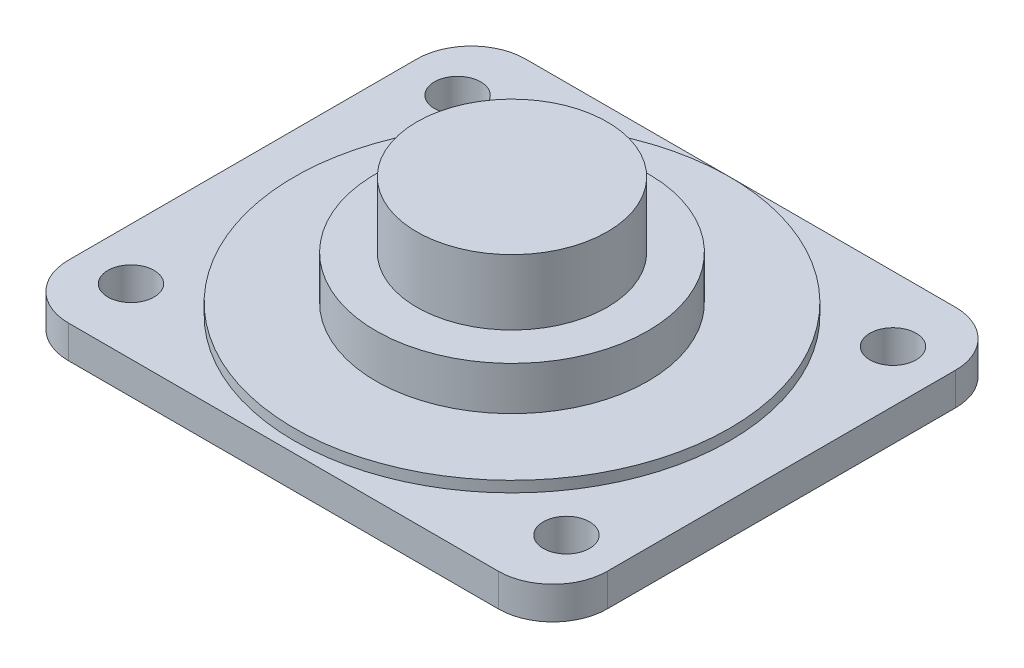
ISO-10303-21;
HEADER;
FILE_DESCRIPTION(('STEP AP214'),'2;1');
FILE_NAME('part.step','',(''),(''),'','','');
FILE_SCHEMA(('AUTOMOTIVE_DESIGN { 1 0 10303 214 1 1 1 1 }'));
ENDSEC;
DATA;
#1=APPLICATION_CONTEXT('core data for automotive mechanical design processes');
#2=APPLICATION_PROTOCOL_DEFINITION('international standard','automotive_design',2000,#1);
#3=PRODUCT_CONTEXT('',#1,'mechanical');
#4=PRODUCT('Part','Part','',(#3));
#5=PRODUCT_RELATED_PRODUCT_CATEGORY('part','',(#4));
#6=PRODUCT_DEFINITION_FORMATION('','',#4);
#7=PRODUCT_DEFINITION_CONTEXT('part definition',#1,'design');
#8=PRODUCT_DEFINITION('design','',#6,#7);
#9=PRODUCT_DEFINITION_SHAPE('','',#8);
#10=(LENGTH_UNIT() NAMED_UNIT(*) SI_UNIT(.MILLI.,.METRE.));
#11=(NAMED_UNIT(*) PLANE_ANGLE_UNIT() SI_UNIT($,.RADIAN.));
#12=(NAMED_UNIT(*) SI_UNIT($,.STERADIAN.) SOLID_ANGLE_UNIT());
#13=UNCERTAINTY_MEASURE_WITH_UNIT(LENGTH_MEASURE(1.E-05),#10,'distance_accuracy_value','');
#14=(GEOMETRIC_REPRESENTATION_CONTEXT(3) GLOBAL_UNCERTAINTY_ASSIGNED_CONTEXT((#13)) GLOBAL_UNIT_ASSIGNED_CONTEXT((#10,
#11,#12)) REPRESENTATION_CONTEXT('',''));
#15=CARTESIAN_POINT('',(0.,0.,0.));
#16=DIRECTION('',(0.,0.,1.));
#17=DIRECTION('',(1.,0.,0.));
#18=AXIS2_PLACEMENT_3D('',#15,#16,#17);
#19=CARTESIAN_POINT('',(-39.5000000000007,6.00000000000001,-32.0000000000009));
#20=DIRECTION('',(0.,1.,0.));
#21=DIRECTION('',(0.,0.,1.00000000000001));
#22=AXIS2_PLACEMENT_3D('',#19,#20,#21);
#23=PLANE('',#22);
#24=CARTESIAN_POINT('',(0.,6.00000000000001,0.));
#25=DIRECTION('',(0.,1.,0.));
#26=DIRECTION('',(0.,0.,1.00000000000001));
#27=AXIS2_PLACEMENT_3D('',#24,#25,#26);
#28=CIRCLE('',#27,40.);
#29=CARTESIAN_POINT('',(0.,6.00000000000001,40.0000000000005));
#30=VERTEX_POINT('',#29);
#31=EDGE_CURVE('E11',#30,#30,#28,.T.);
#32=ORIENTED_EDGE('',*,*,#31,.F.);
#33=EDGE_LOOP('',(#32));
#34=FACE_BOUND('',#33,.T.);
#35=CARTESIAN_POINT('',(40.0000000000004,6.00000000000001,29.9999999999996));
#36=DIRECTION('',(0.,1.,0.));
#37=DIRECTION('',(0.,0.,1.00000000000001));
#38=AXIS2_PLACEMENT_3D('',#35,#36,#37);
#39=CIRCLE('',#38,4.25);
#40=CARTESIAN_POINT('',(40.0000000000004,6.00000000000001,34.2499999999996));
#41=VERTEX_POINT('',#40);
#42=EDGE_CURVE('E315',#41,#41,#39,.T.);
#43=ORIENTED_EDGE('',*,*,#42,.F.);
#44=EDGE_LOOP('',(#43));
#45=FACE_BOUND('',#44,.T.);
#46=CARTESIAN_POINT('',(-40.0000000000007,6.00000000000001,-30.000000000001));
#47=DIRECTION('',(0.,1.,0.));
#48=DIRECTION('',(0.,0.,1.00000000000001));
#49=AXIS2_PLACEMENT_3D('',#46,#47,#48);
#50=CIRCLE('',#49,4.25);
#51=CARTESIAN_POINT('',(-40.0000000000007,6.00000000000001,-25.750000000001));
#52=VERTEX_POINT('',#51);
#53=EDGE_CURVE('E128',#52,#52,#50,.T.);
#54=ORIENTED_EDGE('',*,*,#53,.F.);
#55=EDGE_LOOP('',(#54));
#56=FACE_BOUND('',#55,.T.);
#57=CARTESIAN_POINT('',(-39.5000000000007,6.00000000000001,-32.0000000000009));
#58=DIRECTION('',(0.,1.,0.));
#59=DIRECTION('',(0.,0.,1.00000000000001));
#60=AXIS2_PLACEMENT_3D('',#57,#58,#59);
#61=CIRCLE('',#60,10.);
#62=CARTESIAN_POINT('',(-39.5000000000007,6.00000000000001,-42.0000000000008));
#63=VERTEX_POINT('',#62);
#64=CARTESIAN_POINT('',(-49.5000000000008,6.00000000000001,-32.0000000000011));
#65=VERTEX_POINT('',#64);
#66=EDGE_CURVE('E154',#63,#65,#61,.T.);
#67=ORIENTED_EDGE('',*,*,#66,.T.);
#68=DIRECTION('',(0.,0.,1.00000000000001));
#69=VECTOR('',#68,1.);
#70=CARTESIAN_POINT('',(-49.5000000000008,6.00000000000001,-32.0000000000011));
#71=LINE('',#70,#69);
#72=CARTESIAN_POINT('',(-49.5000000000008,6.00000000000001,31.9999999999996));
#73=VERTEX_POINT('',#72);
#74=EDGE_CURVE('E120',#65,#73,#71,.T.);
#75=ORIENTED_EDGE('',*,*,#74,.T.);
#76=CARTESIAN_POINT('',(-39.5000000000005,6.00000000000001,31.9999999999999));
#77=DIRECTION('',(0.,1.,0.));
#78=DIRECTION('',(0.,0.,1.00000000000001));
#79=AXIS2_PLACEMENT_3D('',#76,#77,#78);
#80=CIRCLE('',#79,10.);
#81=CARTESIAN_POINT('',(-39.5000000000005,6.00000000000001,41.9999999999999));
#82=VERTEX_POINT('',#81);
#83=EDGE_CURVE('E158',#73,#82,#80,.T.);
#84=ORIENTED_EDGE('',*,*,#83,.T.);
#85=DIRECTION('',(1.00000000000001,0.,0.));
#86=VECTOR('',#85,1.);
#87=CARTESIAN_POINT('',(-39.5000000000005,6.00000000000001,41.9999999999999));
#88=LINE('',#87,#86);
#89=CARTESIAN_POINT('',(39.5000000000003,6.00000000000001,41.9999999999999));
#90=VERTEX_POINT('',#89);
#91=EDGE_CURVE('E161',#82,#90,#88,.T.);
#92=ORIENTED_EDGE('',*,*,#91,.T.);
#93=CARTESIAN_POINT('',(39.5000000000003,6.00000000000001,31.9999999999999));
#94=DIRECTION('',(0.,1.,0.));
#95=DIRECTION('',(0.,0.,1.00000000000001));
#96=AXIS2_PLACEMENT_3D('',#93,#94,#95);
#97=CIRCLE('',#96,10.);
#98=CARTESIAN_POINT('',(49.5000000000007,6.00000000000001,31.9999999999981));
#99=VERTEX_POINT('',#98);
#100=EDGE_CURVE('E164',#90,#99,#97,.T.);
#101=ORIENTED_EDGE('',*,*,#100,.T.);
#102=DIRECTION('',(0.,0.,-1.00000000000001));
#103=VECTOR('',#102,1.);
#104=CARTESIAN_POINT('',(49.5000000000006,6.00000000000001,-32.0000000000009));
#105=LINE('',#104,#103);
#106=CARTESIAN_POINT('',(49.5000000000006,6.00000000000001,-32.0000000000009));
#107=VERTEX_POINT('',#106);
#108=EDGE_CURVE('E167',#99,#107,#105,.T.);
#109=ORIENTED_EDGE('',*,*,#108,.T.);
#110=CARTESIAN_POINT('',(39.5000000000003,6.00000000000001,-32.0000000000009));
#111=DIRECTION('',(0.,1.,0.));
#112=DIRECTION('',(0.,0.,-1.00000000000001));
#113=AXIS2_PLACEMENT_3D('',#110,#111,#112);
#114=CIRCLE('',#113,10.);
#115=CARTESIAN_POINT('',(39.5000000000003,6.00000000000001,-42.0000000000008));
#116=VERTEX_POINT('',#115);
#117=EDGE_CURVE('E59',#107,#116,#114,.T.);
#118=ORIENTED_EDGE('',*,*,#117,.T.);
#119=DIRECTION('',(-1.00000000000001,0.,0.));
#120=VECTOR('',#119,1.);
#121=CARTESIAN_POINT('',(-39.5000000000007,6.00000000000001,-42.0000000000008));
#122=LINE('',#121,#120);
#123=EDGE_CURVE('E54',#116,#63,#122,.T.);
#124=ORIENTED_EDGE('',*,*,#123,.T.);
#125=EDGE_LOOP('',(#67,#75,#84,#92,#101,#109,#118,#124));
#126=FACE_BOUND('',#125,.T.);
#127=CARTESIAN_POINT('',(40.0000000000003,6.00000000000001,-30.0000000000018));
#128=DIRECTION('',(0.,1.,0.));
#129=DIRECTION('',(0.,0.,1.00000000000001));
#130=AXIS2_PLACEMENT_3D('',#127,#128,#129);
#131=CIRCLE('',#130,4.25);
#132=CARTESIAN_POINT('',(40.0000000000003,6.00000000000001,-25.7500000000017));
#133=VERTEX_POINT('',#132);
#134=EDGE_CURVE('E323',#133,#133,#131,.T.);
#135=ORIENTED_EDGE('',*,*,#134,.F.);
#136=EDGE_LOOP('',(#135));
#137=FACE_BOUND('',#136,.T.);
#138=CARTESIAN_POINT('',(-40.0000000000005,6.00000000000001,29.9999999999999));
#139=DIRECTION('',(0.,1.,0.));
#140=DIRECTION('',(0.,0.,1.00000000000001));
#141=AXIS2_PLACEMENT_3D('',#138,#139,#140);
#142=CIRCLE('',#141,4.25);
#143=CARTESIAN_POINT('',(-40.0000000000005,6.00000000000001,34.25));
#144=VERTEX_POINT('',#143);
#145=EDGE_CURVE('E307',#144,#144,#142,.T.);
#146=ORIENTED_EDGE('',*,*,#145,.F.);
#147=EDGE_LOOP('',(#146));
#148=FACE_BOUND('',#147,.T.);
#149=ADVANCED_FACE('F38',(#34,#45,#56,#126,#137,#148),#23,.T.);
#150=CARTESIAN_POINT('',(-39.5000000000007,0.,-32.0000000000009));
#151=DIRECTION('',(0.,1.,0.));
#152=DIRECTION('',(0.,0.,1.00000000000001));
#153=AXIS2_PLACEMENT_3D('',#150,#151,#152);
#154=PLANE('',#153);
#155=CARTESIAN_POINT('',(40.0000000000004,0.,29.9999999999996));
#156=DIRECTION('',(0.,1.,0.));
#157=DIRECTION('',(0.,0.,1.00000000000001));
#158=AXIS2_PLACEMENT_3D('',#155,#156,#157);
#159=CIRCLE('',#158,4.25);
#160=CARTESIAN_POINT('',(40.0000000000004,0.,34.2499999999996));
#161=VERTEX_POINT('',#160);
#162=EDGE_CURVE('E311',#161,#161,#159,.T.);
#163=ORIENTED_EDGE('',*,*,#162,.T.);
#164=EDGE_LOOP('',(#163));
#165=FACE_BOUND('',#164,.T.);
#166=CARTESIAN_POINT('',(-40.0000000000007,0.,-30.000000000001));
#167=DIRECTION('',(0.,1.,0.));
#168=DIRECTION('',(0.,0.,1.00000000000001));
#169=AXIS2_PLACEMENT_3D('',#166,#167,#168);
#170=CIRCLE('',#169,4.25);
#171=CARTESIAN_POINT('',(-40.0000000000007,0.,-25.750000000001));
#172=VERTEX_POINT('',#171);
#173=EDGE_CURVE('E133',#172,#172,#170,.T.);
#174=ORIENTED_EDGE('',*,*,#173,.T.);
#175=EDGE_LOOP('',(#174));
#176=FACE_BOUND('',#175,.T.);
#177=CARTESIAN_POINT('',(-39.5000000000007,0.,-32.0000000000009));
#178=DIRECTION('',(0.,1.,0.));
#179=DIRECTION('',(0.,0.,1.00000000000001));
#180=AXIS2_PLACEMENT_3D('',#177,#178,#179);
#181=CIRCLE('',#180,10.);
#182=CARTESIAN_POINT('',(-39.5000000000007,0.,-42.0000000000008));
#183=VERTEX_POINT('',#182);
#184=CARTESIAN_POINT('',(-49.5000000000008,0.,-32.0000000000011));
#185=VERTEX_POINT('',#184);
#186=EDGE_CURVE('E110',#183,#185,#181,.T.);
#187=ORIENTED_EDGE('',*,*,#186,.F.);
#188=DIRECTION('',(-1.00000000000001,0.,0.));
#189=VECTOR('',#188,1.);
#190=CARTESIAN_POINT('',(-39.5000000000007,0.,-42.0000000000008));
#191=LINE('',#190,#189);
#192=CARTESIAN_POINT('',(39.5000000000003,0.,-42.0000000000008));
#193=VERTEX_POINT('',#192);
#194=EDGE_CURVE('E151',#193,#183,#191,.T.);
#195=ORIENTED_EDGE('',*,*,#194,.F.);
#196=CARTESIAN_POINT('',(39.5000000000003,0.,-32.0000000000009));
#197=DIRECTION('',(0.,1.,0.));
#198=DIRECTION('',(0.,0.,-1.00000000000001));
#199=AXIS2_PLACEMENT_3D('',#196,#197,#198);
#200=CIRCLE('',#199,10.);
#201=CARTESIAN_POINT('',(49.5000000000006,0.,-32.0000000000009));
#202=VERTEX_POINT('',#201);
#203=EDGE_CURVE('E148',#202,#193,#200,.T.);
#204=ORIENTED_EDGE('',*,*,#203,.F.);
#205=DIRECTION('',(0.,0.,-1.00000000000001));
#206=VECTOR('',#205,1.);
#207=CARTESIAN_POINT('',(49.5000000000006,0.,-32.0000000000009));
#208=LINE('',#207,#206);
#209=CARTESIAN_POINT('',(49.5000000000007,0.,31.9999999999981));
#210=VERTEX_POINT('',#209);
#211=EDGE_CURVE('E145',#210,#202,#208,.T.);
#212=ORIENTED_EDGE('',*,*,#211,.F.);
#213=CARTESIAN_POINT('',(39.5000000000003,0.,31.9999999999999));
#214=DIRECTION('',(0.,1.,0.));
#215=DIRECTION('',(0.,0.,1.00000000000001));
#216=AXIS2_PLACEMENT_3D('',#213,#214,#215);
#217=CIRCLE('',#216,10.);
#218=CARTESIAN_POINT('',(39.5000000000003,0.,41.9999999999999));
#219=VERTEX_POINT('',#218);
#220=EDGE_CURVE('E142',#219,#210,#217,.T.);
#221=ORIENTED_EDGE('',*,*,#220,.F.);
#222=DIRECTION('',(1.00000000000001,0.,0.));
#223=VECTOR('',#222,1.);
#224=CARTESIAN_POINT('',(-39.5000000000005,0.,41.9999999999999));
#225=LINE('',#224,#223);
#226=CARTESIAN_POINT('',(-39.5000000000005,0.,41.9999999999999));
#227=VERTEX_POINT('',#226);
#228=EDGE_CURVE('E139',#227,#219,#225,.T.);
#229=ORIENTED_EDGE('',*,*,#228,.F.);
#230=CARTESIAN_POINT('',(-39.5000000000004,0.,31.9999999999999));
#231=DIRECTION('',(0.,1.,0.));
#232=DIRECTION('',(0.,0.,1.00000000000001));
#233=AXIS2_PLACEMENT_3D('',#230,#231,#232);
#234=CIRCLE('',#233,10.);
#235=CARTESIAN_POINT('',(-49.5000000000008,0.,31.9999999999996));
#236=VERTEX_POINT('',#235);
#237=EDGE_CURVE('E112',#236,#227,#234,.T.);
#238=ORIENTED_EDGE('',*,*,#237,.F.);
#239=DIRECTION('',(0.,0.,1.00000000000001));
#240=VECTOR('',#239,1.);
#241=CARTESIAN_POINT('',(-49.5000000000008,0.,-32.0000000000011));
#242=LINE('',#241,#240);
#243=EDGE_CURVE('E104',#185,#236,#242,.T.);
#244=ORIENTED_EDGE('',*,*,#243,.F.);
#245=EDGE_LOOP('',(#187,#195,#204,#212,#221,#229,#238,#244));
#246=FACE_BOUND('',#245,.T.);
#247=CARTESIAN_POINT('',(40.0000000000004,0.,-30.0000000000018));
#248=DIRECTION('',(0.,1.,0.));
#249=DIRECTION('',(0.,0.,1.00000000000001));
#250=AXIS2_PLACEMENT_3D('',#247,#248,#249);
#251=CIRCLE('',#250,4.25);
#252=CARTESIAN_POINT('',(40.0000000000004,0.,-25.7500000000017));
#253=VERTEX_POINT('',#252);
#254=EDGE_CURVE('E319',#253,#253,#251,.T.);
#255=ORIENTED_EDGE('',*,*,#254,.T.);
#256=EDGE_LOOP('',(#255));
#257=FACE_BOUND('',#256,.T.);
#258=CARTESIAN_POINT('',(-40.0000000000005,0.,29.9999999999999));
#259=DIRECTION('',(0.,1.,0.));
#260=DIRECTION('',(0.,0.,1.00000000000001));
#261=AXIS2_PLACEMENT_3D('',#258,#259,#260);
#262=CIRCLE('',#261,4.25);
#263=CARTESIAN_POINT('',(-40.0000000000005,0.,34.25));
#264=VERTEX_POINT('',#263);
#265=EDGE_CURVE('E303',#264,#264,#262,.T.);
#266=ORIENTED_EDGE('',*,*,#265,.T.);
#267=EDGE_LOOP('',(#266));
#268=FACE_BOUND('',#267,.T.);
#269=ADVANCED_FACE('F106',(#165,#176,#246,#257,#268),#154,.F.);
#270=CARTESIAN_POINT('',(-39.5000000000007,6.00000000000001,-32.0000000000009));
#271=DIRECTION('',(0.,-1.,0.));
#272=DIRECTION('',(0.,0.,-1.00000000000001));
#273=AXIS2_PLACEMENT_3D('',#270,#271,#272);
#274=CYLINDRICAL_SURFACE('',#273,10.);
#275=ORIENTED_EDGE('',*,*,#186,.T.);
#276=DIRECTION('',(0.,-1.,0.));
#277=VECTOR('',#276,1.);
#278=CARTESIAN_POINT('',(-49.5000000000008,6.00000000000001,-32.0000000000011));
#279=LINE('',#278,#277);
#280=EDGE_CURVE('E47',#65,#185,#279,.T.);
#281=ORIENTED_EDGE('',*,*,#280,.F.);
#282=ORIENTED_EDGE('',*,*,#66,.F.);
#283=DIRECTION('',(0.,-1.,0.));
#284=VECTOR('',#283,1.);
#285=CARTESIAN_POINT('',(-39.5000000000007,6.00000000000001,-42.0000000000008));
#286=LINE('',#285,#284);
#287=EDGE_CURVE('E126',#63,#183,#286,.T.);
#288=ORIENTED_EDGE('',*,*,#287,.T.);
#289=EDGE_LOOP('',(#275,#281,#282,#288));
#290=FACE_BOUND('',#289,.T.);
#291=ADVANCED_FACE('F40',(#290),#274,.T.);
#292=CARTESIAN_POINT('',(-49.5000000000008,6.00000000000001,-32.0000000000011));
#293=DIRECTION('',(1.00000000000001,0.,0.));
#294=DIRECTION('',(0.,0.,-1.00000000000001));
#295=AXIS2_PLACEMENT_3D('',#292,#293,#294);
#296=PLANE('',#295);
#297=ORIENTED_EDGE('',*,*,#243,.T.);
#298=DIRECTION('',(0.,-1.,0.));
#299=VECTOR('',#298,1.);
#300=CARTESIAN_POINT('',(-49.5000000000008,6.00000000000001,31.9999999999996));
#301=LINE('',#300,#299);
#302=EDGE_CURVE('E124',#73,#236,#301,.T.);
#303=ORIENTED_EDGE('',*,*,#302,.F.);
#304=ORIENTED_EDGE('',*,*,#74,.F.);
#305=ORIENTED_EDGE('',*,*,#280,.T.);
#306=EDGE_LOOP('',(#297,#303,#304,#305));
#307=FACE_BOUND('',#306,.T.);
#308=ADVANCED_FACE('F119',(#307),#296,.F.);
#309=CARTESIAN_POINT('',(-39.5000000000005,6.00000000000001,31.9999999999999));
#310=DIRECTION('',(0.,-1.,0.));
#311=DIRECTION('',(0.,0.,-1.00000000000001));
#312=AXIS2_PLACEMENT_3D('',#309,#310,#311);
#313=CYLINDRICAL_SURFACE('',#312,10.);
#314=ORIENTED_EDGE('',*,*,#237,.T.);
#315=DIRECTION('',(0.,-1.,0.));
#316=VECTOR('',#315,1.);
#317=CARTESIAN_POINT('',(-39.5000000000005,6.00000000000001,41.9999999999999));
#318=LINE('',#317,#316);
#319=EDGE_CURVE('E192',#82,#227,#318,.T.);
#320=ORIENTED_EDGE('',*,*,#319,.F.);
#321=ORIENTED_EDGE('',*,*,#83,.F.);
#322=ORIENTED_EDGE('',*,*,#302,.T.);
#323=EDGE_LOOP('',(#314,#320,#321,#322));
#324=FACE_BOUND('',#323,.T.);
#325=ADVANCED_FACE('F199',(#324),#313,.T.);
#326=CARTESIAN_POINT('',(-39.5000000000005,6.00000000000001,41.9999999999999));
#327=DIRECTION('',(0.,0.,-1.00000000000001));
#328=DIRECTION('',(-1.00000000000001,0.,0.));
#329=AXIS2_PLACEMENT_3D('',#326,#327,#328);
#330=PLANE('',#329);
#331=ORIENTED_EDGE('',*,*,#228,.T.);
#332=DIRECTION('',(0.,-1.,0.));
#333=VECTOR('',#332,1.);
#334=CARTESIAN_POINT('',(39.5000000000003,6.00000000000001,41.9999999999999));
#335=LINE('',#334,#333);
#336=EDGE_CURVE('E188',#90,#219,#335,.T.);
#337=ORIENTED_EDGE('',*,*,#336,.F.);
#338=ORIENTED_EDGE('',*,*,#91,.F.);
#339=ORIENTED_EDGE('',*,*,#319,.T.);
#340=EDGE_LOOP('',(#331,#337,#338,#339));
#341=FACE_BOUND('',#340,.T.);
#342=ADVANCED_FACE('F207',(#341),#330,.F.);
#343=CARTESIAN_POINT('',(39.5000000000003,6.00000000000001,31.9999999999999));
#344=DIRECTION('',(0.,-1.,0.));
#345=DIRECTION('',(0.,0.,-1.00000000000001));
#346=AXIS2_PLACEMENT_3D('',#343,#344,#345);
#347=CYLINDRICAL_SURFACE('',#346,10.);
#348=ORIENTED_EDGE('',*,*,#220,.T.);
#349=DIRECTION('',(0.,-1.,0.));
#350=VECTOR('',#349,1.);
#351=CARTESIAN_POINT('',(49.5000000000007,6.00000000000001,31.9999999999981));
#352=LINE('',#351,#350);
#353=EDGE_CURVE('E184',#99,#210,#352,.T.);
#354=ORIENTED_EDGE('',*,*,#353,.F.);
#355=ORIENTED_EDGE('',*,*,#100,.F.);
#356=ORIENTED_EDGE('',*,*,#336,.T.);
#357=EDGE_LOOP('',(#348,#354,#355,#356));
#358=FACE_BOUND('',#357,.T.);
#359=ADVANCED_FACE('F210',(#358),#347,.T.);
#360=CARTESIAN_POINT('',(49.5000000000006,6.00000000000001,-32.0000000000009));
#361=DIRECTION('',(-1.00000000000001,0.,0.));
#362=DIRECTION('',(0.,0.,1.00000000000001));
#363=AXIS2_PLACEMENT_3D('',#360,#361,#362);
#364=PLANE('',#363);
#365=ORIENTED_EDGE('',*,*,#211,.T.);
#366=DIRECTION('',(0.,-1.,0.));
#367=VECTOR('',#366,1.);
#368=CARTESIAN_POINT('',(49.5000000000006,6.00000000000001,-32.0000000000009));
#369=LINE('',#368,#367);
#370=EDGE_CURVE('E180',#107,#202,#369,.T.);
#371=ORIENTED_EDGE('',*,*,#370,.F.);
#372=ORIENTED_EDGE('',*,*,#108,.F.);
#373=ORIENTED_EDGE('',*,*,#353,.T.);
#374=EDGE_LOOP('',(#365,#371,#372,#373));
#375=FACE_BOUND('',#374,.T.);
#376=ADVANCED_FACE('F215',(#375),#364,.F.);
#377=CARTESIAN_POINT('',(39.5000000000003,6.00000000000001,-32.0000000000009));
#378=DIRECTION('',(0.,-1.,0.));
#379=DIRECTION('',(0.,0.,-1.00000000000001));
#380=AXIS2_PLACEMENT_3D('',#377,#378,#379);
#381=CYLINDRICAL_SURFACE('',#380,10.);
#382=ORIENTED_EDGE('',*,*,#203,.T.);
#383=DIRECTION('',(0.,-1.,0.));
#384=VECTOR('',#383,1.);
#385=CARTESIAN_POINT('',(39.5000000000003,6.00000000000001,-42.0000000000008));
#386=LINE('',#385,#384);
#387=EDGE_CURVE('E176',#116,#193,#386,.T.);
#388=ORIENTED_EDGE('',*,*,#387,.F.);
#389=ORIENTED_EDGE('',*,*,#117,.F.);
#390=ORIENTED_EDGE('',*,*,#370,.T.);
#391=EDGE_LOOP('',(#382,#388,#389,#390));
#392=FACE_BOUND('',#391,.T.);
#393=ADVANCED_FACE('F218',(#392),#381,.T.);
#394=CARTESIAN_POINT('',(-39.5000000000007,6.00000000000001,-42.0000000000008));
#395=DIRECTION('',(0.,0.,1.00000000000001));
#396=DIRECTION('',(1.00000000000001,0.,0.));
#397=AXIS2_PLACEMENT_3D('',#394,#395,#396);
#398=PLANE('',#397);
#399=ORIENTED_EDGE('',*,*,#194,.T.);
#400=ORIENTED_EDGE('',*,*,#287,.F.);
#401=ORIENTED_EDGE('',*,*,#123,.F.);
#402=ORIENTED_EDGE('',*,*,#387,.T.);
#403=EDGE_LOOP('',(#399,#400,#401,#402));
#404=FACE_BOUND('',#403,.T.);
#405=ADVANCED_FACE('F220',(#404),#398,.F.);
#406=CARTESIAN_POINT('',(-40.0000000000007,6.00000000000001,-30.000000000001));
#407=DIRECTION('',(0.,-1.,0.));
#408=DIRECTION('',(0.,0.,-1.00000000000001));
#409=AXIS2_PLACEMENT_3D('',#406,#407,#408);
#410=CYLINDRICAL_SURFACE('',#409,4.25);
#411=ORIENTED_EDGE('',*,*,#53,.T.);
#412=EDGE_LOOP('',(#411));
#413=FACE_BOUND('',#412,.T.);
#414=ORIENTED_EDGE('',*,*,#173,.F.);
#415=EDGE_LOOP('',(#414));
#416=FACE_BOUND('',#415,.T.);
#417=ADVANCED_FACE('F222',(#413,#416),#410,.F.);
#418=CARTESIAN_POINT('',(40.0000000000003,6.00000000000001,-30.0000000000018));
#419=DIRECTION('',(0.,-1.,0.));
#420=DIRECTION('',(0.,0.,-1.00000000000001));
#421=AXIS2_PLACEMENT_3D('',#418,#419,#420);
#422=CYLINDRICAL_SURFACE('',#421,4.25);
#423=ORIENTED_EDGE('',*,*,#134,.T.);
#424=EDGE_LOOP('',(#423));
#425=FACE_BOUND('',#424,.T.);
#426=ORIENTED_EDGE('',*,*,#254,.F.);
#427=EDGE_LOOP('',(#426));
#428=FACE_BOUND('',#427,.T.);
#429=ADVANCED_FACE('F228',(#425,#428),#422,.F.);
#430=CARTESIAN_POINT('',(40.0000000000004,6.00000000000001,29.9999999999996));
#431=DIRECTION('',(0.,-1.,0.));
#432=DIRECTION('',(0.,0.,-1.00000000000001));
#433=AXIS2_PLACEMENT_3D('',#430,#431,#432);
#434=CYLINDRICAL_SURFACE('',#433,4.25);
#435=ORIENTED_EDGE('',*,*,#42,.T.);
#436=EDGE_LOOP('',(#435));
#437=FACE_BOUND('',#436,.T.);
#438=ORIENTED_EDGE('',*,*,#162,.F.);
#439=EDGE_LOOP('',(#438));
#440=FACE_BOUND('',#439,.T.);
#441=ADVANCED_FACE('F245',(#437,#440),#434,.F.);
#442=CARTESIAN_POINT('',(-40.0000000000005,6.00000000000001,29.9999999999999));
#443=DIRECTION('',(0.,-1.,0.));
#444=DIRECTION('',(0.,0.,-1.00000000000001));
#445=AXIS2_PLACEMENT_3D('',#442,#443,#444);
#446=CYLINDRICAL_SURFACE('',#445,4.25);
#447=ORIENTED_EDGE('',*,*,#145,.T.);
#448=EDGE_LOOP('',(#447));
#449=FACE_BOUND('',#448,.T.);
#450=ORIENTED_EDGE('',*,*,#265,.F.);
#451=EDGE_LOOP('',(#450));
#452=FACE_BOUND('',#451,.T.);
#453=ADVANCED_FACE('F249',(#449,#452),#446,.F.);
#454=CARTESIAN_POINT('',(0.,28.,0.));
#455=DIRECTION('',(0.,1.,0.));
#456=DIRECTION('',(-1.00000000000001,0.,0.));
#457=AXIS2_PLACEMENT_3D('',#454,#455,#456);
#458=PLANE('',#457);
#459=CARTESIAN_POINT('',(0.,28.,0.));
#460=DIRECTION('',(0.,-1.,0.));
#461=DIRECTION('',(1.00000000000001,0.,0.));
#462=AXIS2_PLACEMENT_3D('',#459,#460,#461);
#463=CIRCLE('',#462,17.5);
#464=CARTESIAN_POINT('',(17.5000000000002,28.,0.));
#465=VERTEX_POINT('',#464);
#466=EDGE_CURVE('E299',#465,#465,#463,.T.);
#467=ORIENTED_EDGE('',*,*,#466,.F.);
#468=EDGE_LOOP('',(#467));
#469=FACE_BOUND('',#468,.T.);
#470=ADVANCED_FACE('F253',(#469),#458,.T.);
#471=CARTESIAN_POINT('',(0.,6.00000000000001,0.));
#472=DIRECTION('',(0.,-1.,0.));
#473=DIRECTION('',(1.00000000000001,0.,0.));
#474=AXIS2_PLACEMENT_3D('',#471,#472,#473);
#475=CYLINDRICAL_SURFACE('',#474,17.5);
#476=ORIENTED_EDGE('',*,*,#466,.T.);
#477=EDGE_LOOP('',(#476));
#478=FACE_BOUND('',#477,.T.);
#479=CARTESIAN_POINT('',(0.,16.,0.));
#480=DIRECTION('',(0.,-1.,0.));
#481=DIRECTION('',(1.00000000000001,0.,0.));
#482=AXIS2_PLACEMENT_3D('',#479,#480,#481);
#483=CIRCLE('',#482,17.5);
#484=CARTESIAN_POINT('',(17.5000000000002,16.,0.));
#485=VERTEX_POINT('',#484);
#486=EDGE_CURVE('E295',#485,#485,#483,.T.);
#487=ORIENTED_EDGE('',*,*,#486,.F.);
#488=EDGE_LOOP('',(#487));
#489=FACE_BOUND('',#488,.T.);
#490=ADVANCED_FACE('F257',(#478,#489),#475,.T.);
#491=CARTESIAN_POINT('',(17.5000000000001,16.,-1.38777878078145E-12));
#492=DIRECTION('',(0.,1.,0.));
#493=DIRECTION('',(-1.00000000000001,0.,0.));
#494=AXIS2_PLACEMENT_3D('',#491,#492,#493);
#495=PLANE('',#494);
#496=ORIENTED_EDGE('',*,*,#486,.T.);
#497=EDGE_LOOP('',(#496));
#498=FACE_BOUND('',#497,.T.);
#499=CARTESIAN_POINT('',(0.,16.,0.));
#500=DIRECTION('',(0.,-1.,0.));
#501=DIRECTION('',(1.00000000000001,0.,0.));
#502=AXIS2_PLACEMENT_3D('',#499,#500,#501);
#503=CIRCLE('',#502,25.);
#504=CARTESIAN_POINT('',(25.0000000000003,16.,0.));
#505=VERTEX_POINT('',#504);
#506=EDGE_CURVE('E289',#505,#505,#503,.T.);
#507=ORIENTED_EDGE('',*,*,#506,.F.);
#508=EDGE_LOOP('',(#507));
#509=FACE_BOUND('',#508,.T.);
#510=ADVANCED_FACE('F261',(#498,#509),#495,.T.);
#511=CARTESIAN_POINT('',(0.,6.00000000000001,0.));
#512=DIRECTION('',(0.,-1.,0.));
#513=DIRECTION('',(1.00000000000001,0.,0.));
#514=AXIS2_PLACEMENT_3D('',#511,#512,#513);
#515=CYLINDRICAL_SURFACE('',#514,25.);
#516=ORIENTED_EDGE('',*,*,#506,.T.);
#517=EDGE_LOOP('',(#516));
#518=FACE_BOUND('',#517,.T.);
#519=CARTESIAN_POINT('',(0.,8.00000000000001,0.));
#520=DIRECTION('',(0.,-1.,0.));
#521=DIRECTION('',(1.00000000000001,0.,0.));
#522=AXIS2_PLACEMENT_3D('',#519,#520,#521);
#523=CIRCLE('',#522,25.);
#524=CARTESIAN_POINT('',(25.0000000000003,8.00000000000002,0.));
#525=VERTEX_POINT('',#524);
#526=EDGE_CURVE('E285',#525,#525,#523,.T.);
#527=ORIENTED_EDGE('',*,*,#526,.F.);
#528=EDGE_LOOP('',(#527));
#529=FACE_BOUND('',#528,.T.);
#530=ADVANCED_FACE('F265',(#518,#529),#515,.T.);
#531=CARTESIAN_POINT('',(25.0000000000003,8.00000000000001,-1.38777878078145E-12));
#532=DIRECTION('',(0.,1.,0.));
#533=DIRECTION('',(-1.00000000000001,0.,0.));
#534=AXIS2_PLACEMENT_3D('',#531,#532,#533);
#535=PLANE('',#534);
#536=ORIENTED_EDGE('',*,*,#526,.T.);
#537=EDGE_LOOP('',(#536));
#538=FACE_BOUND('',#537,.T.);
#539=CARTESIAN_POINT('',(0.,8.00000000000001,0.));
#540=DIRECTION('',(0.,-1.,0.));
#541=DIRECTION('',(1.00000000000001,0.,0.));
#542=AXIS2_PLACEMENT_3D('',#539,#540,#541);
#543=CIRCLE('',#542,40.);
#544=CARTESIAN_POINT('',(40.0000000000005,8.00000000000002,0.));
#545=VERTEX_POINT('',#544);
#546=EDGE_CURVE('E282',#545,#545,#543,.T.);
#547=ORIENTED_EDGE('',*,*,#546,.F.);
#548=EDGE_LOOP('',(#547));
#549=FACE_BOUND('',#548,.T.);
#550=ADVANCED_FACE('F269',(#538,#549),#535,.T.);
#551=CARTESIAN_POINT('',(0.,6.00000000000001,0.));
#552=DIRECTION('',(0.,-1.,0.));
#553=DIRECTION('',(1.00000000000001,0.,0.));
#554=AXIS2_PLACEMENT_3D('',#551,#552,#553);
#555=CYLINDRICAL_SURFACE('',#554,40.);
#556=ORIENTED_EDGE('',*,*,#546,.T.);
#557=EDGE_LOOP('',(#556));
#558=FACE_BOUND('',#557,.T.);
#559=ORIENTED_EDGE('',*,*,#31,.T.);
#560=EDGE_LOOP('',(#559));
#561=FACE_BOUND('',#560,.T.);
#562=ADVANCED_FACE('F273',(#558,#561),#555,.T.);
#563=CLOSED_SHELL('',(#149,#269,#291,#308,#325,#342,#359,#376,#393,#405,#417,#429,#441,#453,
#470,#490,#510,#530,#550,#562));
#564=MANIFOLD_SOLID_BREP('B2',#563);
#565=ADVANCED_BREP_SHAPE_REPRESENTATION('',(#18,#564),#14);
#566=SHAPE_DEFINITION_REPRESENTATION(#9,#565);
ENDSEC;
END-ISO-10303-21;
